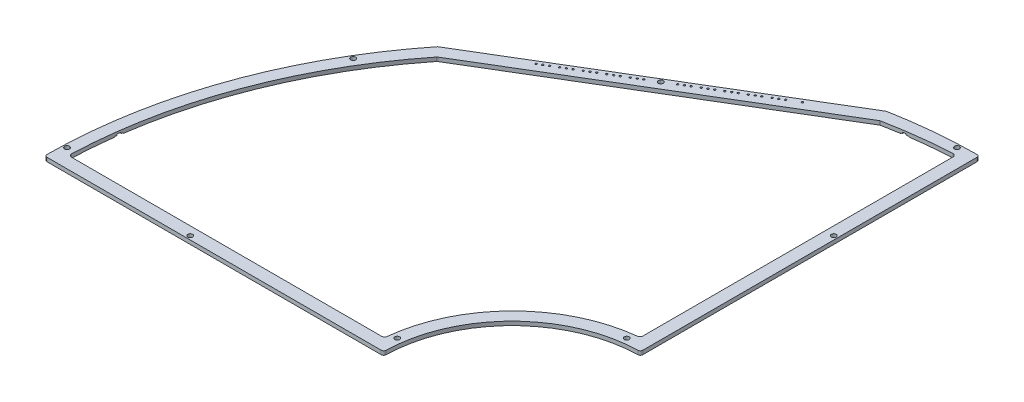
from build123d import *

# Parameters (mm, degrees)
EXTRUDE1_DEPTH  = 3.175
SKETCH2_R       = 2
EXTRUDE4_DEPTH  = 539.824257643
SKETCH4_R       = 0.75
EXTRUDE5_DEPTH  = 539.824257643
EXTRUDE6_START  = 3.175
EXTRUDE6_DEPTH  = 0.5
EXTRUDE9_DEPTH  = 1
EXTRUDE7_START  = 3.175
EXTRUDE7_DEPTH  = 0.5
EXTRUDE10_DEPTH = 1
FILLET2_R       = 2


with BuildPart() as part:
    # Sketch1 → Extrude1 (new body)
    with BuildSketch(Plane(origin=(0, 0, 0), x_dir=(1, 0, 0), z_dir=(0, 1, 0))):
        with BuildLine():
            Line((-69.791249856, 374.553309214), (-297.945935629, 237.464143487))
            ThreePointArc((-297.945935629, 237.464143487), (-359.554983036, 126.020689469), (-380.999671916, 0.5))
            Line((-380.999671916, 0.5), (-104.998809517, 0.5))
            ThreePointArc((-104.998809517, 0.5), (-74.246212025, 74.246212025), (-0.5, 104.998809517))
            Line((-0.5, 104.998809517), (-0.5, 380.999671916))
            ThreePointArc((-0.5, 380.999671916), (-35.293113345, 379.361827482), (-69.791249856, 374.553309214))
        make_face()
        with BuildLine():
            Line((-66.120558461, 365.092549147), (-290.534750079, 230.250899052))
            ThreePointArc((-290.534750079, 230.250899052), (-290.878735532, 229.999778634), (-291.172485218, 229.69139806))
            ThreePointArc((-291.172485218, 229.69139806), (-348.625003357, 127.74342555), (-371.465132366, 12.971872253))
            ThreePointArc((-371.465132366, 12.971872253), (-370.801146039, 11.229802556), (-369.085607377, 10.5))
            Line((-369.085607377, 10.5), (-116.627737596, 10.5))
            ThreePointArc((-116.627737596, 10.5), (-115.036426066, 11.10978756), (-114.260116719, 12.626842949))
            ThreePointArc((-114.260116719, 12.626842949), (-81.382579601, 81.510553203), (-12.618278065, 114.637110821))
            ThreePointArc((-12.618278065, 114.637110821), (-11.106911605, 115.415691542), (-10.5, 117.003795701))
            Line((-10.5, 117.003795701), (-10.5, 369.493251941))
            ThreePointArc((-10.5, 369.493251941), (-11.241858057, 371.220314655), (-13.005193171, 371.871274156))
            ThreePointArc((-13.005193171, 371.871274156), (-39.295002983, 369.561100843), (-65.354066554, 365.387827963))
            ThreePointArc((-65.354066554, 365.387827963), (-65.750140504, 365.273487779), (-66.120558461, 365.092549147))
        make_face(mode=Mode.SUBTRACT)
    extrude(amount=EXTRUDE1_DEPTH)

    # Sketch2 → Extrude4 (cut, through all)
    with BuildSketch(Plane(origin=(0, 0, 0), x_dir=(1, 0, 0), z_dir=(0, 1, 0))):
        with Locations(Location((-377.682075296, 15.5, 0), (0, 0, 270))):
            Circle(SKETCH2_R)
        with Locations(Location((-324.009239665, 194.684392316, 0), (0, 0, 270))):
            Circle(SKETCH2_R)
        with Locations(Location((-108.902479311, 15.5, 0), (0, 0, 270))):
            Circle(SKETCH2_R)
        with Locations(Location((-182.323478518, 303.437224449, 0), (0, 0, 270))):
            Circle(SKETCH2_R)
        with Locations(Location((-15.5, 108.902479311, 0), (0, 0, 270))):
            Circle(SKETCH2_R)
        with Locations(Location((-15.5, 377.682075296, 0), (0, 0, 270))):
            Circle(SKETCH2_R)
        with Locations(Location((-3.5, 265.406923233, 0), (0, 0, 270))):
            Circle(SKETCH2_R)
        with Locations(Location((-265.406923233, 3.5, 0), (0, 0, 270))):
            Circle(SKETCH2_R)
    extrude(amount=EXTRUDE4_DEPTH, mode=Mode.SUBTRACT)

    # Sketch4 → Extrude5 (cut, through all)
    with BuildSketch(Plane.XZ):
        with Locations(Location((-190.895151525, -298.286843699, 0), (0, 0, 270))):
            Circle(SKETCH4_R)
        with Locations(Location((-202.895493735, -291.076310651, 0), (0, 0, 270))):
            Circle(SKETCH4_R)
        with Locations(Location((-206.324162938, -289.016158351, 0), (0, 0, 270))):
            Circle(SKETCH4_R)
        with Locations(Location((-194.323820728, -296.2266914, 0), (0, 0, 270))):
            Circle(SKETCH4_R)
        with Locations(Location((-197.752489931, -294.1665391, 0), (0, 0, 270))):
            Circle(SKETCH4_R)
        with Locations(Location((-209.752832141, -286.956006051, 0), (0, 0, 270))):
            Circle(SKETCH4_R)
        with Locations(Location((-214.895835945, -283.865777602, 0), (0, 0, 270))):
            Circle(SKETCH4_R)
        with Locations(Location((-218.324505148, -281.805625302, 0), (0, 0, 270))):
            Circle(SKETCH4_R)
        with Locations(Location((-221.75317435, -279.745473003, 0), (0, 0, 270))):
            Circle(SKETCH4_R)
        with Locations(Location((-226.896178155, -276.655244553, 0), (0, 0, 270))):
            Circle(SKETCH4_R)
        with Locations(Location((-230.324847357, -274.595092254, 0), (0, 0, 270))):
            Circle(SKETCH4_R)
        with Locations(Location((-233.75351656, -272.534939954, 0), (0, 0, 270))):
            Circle(SKETCH4_R)
        with Locations(Location((-238.896520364, -269.444711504, 0), (0, 0, 270))):
            Circle(SKETCH4_R)
        with Locations(Location((-242.325189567, -267.384559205, 0), (0, 0, 270))):
            Circle(SKETCH4_R)
        with Locations(Location((-245.75385877, -265.324406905, 0), (0, 0, 270))):
            Circle(SKETCH4_R)
        with Locations(Location((-118.893098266, -341.550041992, 0), (0, 0, 90))):
            Circle(SKETCH4_R)
        with Locations(Location((-122.321767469, -339.489889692, 0), (0, 0, 90))):
            Circle(SKETCH4_R)
        with Locations(Location((-125.750436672, -337.429737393, 0), (0, 0, 90))):
            Circle(SKETCH4_R)
        with Locations(Location((-130.893440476, -334.339508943, 0), (0, 0, 90))):
            Circle(SKETCH4_R)
        with Locations(Location((-134.322109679, -332.279356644, 0), (0, 0, 90))):
            Circle(SKETCH4_R)
        with Locations(Location((-137.750778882, -330.219204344, 0), (0, 0, 90))):
            Circle(SKETCH4_R)
        with Locations(Location((-142.893782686, -327.128975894, 0), (0, 0, 90))):
            Circle(SKETCH4_R)
        with Locations(Location((-146.322451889, -325.068823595, 0), (0, 0, 90))):
            Circle(SKETCH4_R)
        with Locations(Location((-149.751121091, -323.008671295, 0), (0, 0, 90))):
            Circle(SKETCH4_R)
        with Locations(Location((-154.894124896, -319.918442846, 0), (0, 0, 90))):
            Circle(SKETCH4_R)
        with Locations(Location((-166.894467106, -312.707909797, 0), (0, 0, 90))):
            Circle(SKETCH4_R)
        with Locations(Location((-170.323136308, -310.647757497, 0), (0, 0, 90))):
            Circle(SKETCH4_R)
        with Locations(Location((-158.322794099, -317.858290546, 0), (0, 0, 90))):
            Circle(SKETCH4_R)
        with Locations(Location((-161.751463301, -315.798138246, 0), (0, 0, 90))):
            Circle(SKETCH4_R)
        with Locations(Location((-173.751805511, -308.587605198, 0), (0, 0, 90))):
            Circle(SKETCH4_R)
        with Locations(Location((-110.321425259, -346.700422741, 0), (0, 0, 270))):
            Circle(SKETCH4_R)
    extrude(amount=-EXTRUDE5_DEPTH, mode=Mode.SUBTRACT)

    # Sketch6 → Extrude6 (cut)
    with BuildSketch(Plane(origin=(0, 3.175, -3.175), x_dir=(1, 0, 0), z_dir=(0, -1, 0)).offset(EXTRUDE6_START)):
        with BuildLine():
            Line((-52.052182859, -369.2166893), (-50.746920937, -359.302240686))
            Line((-50.746920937, -359.302240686), (-44.798251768, -360.085397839))
            Line((-44.798251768, -360.085397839), (-46.103513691, -369.999846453))
            ThreePointArc((-46.103513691, -369.999846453), (-49.469426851, -372.582602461), (-52.052182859, -369.2166893))
        make_face()
    extrude(amount=-EXTRUDE6_DEPTH, mode=Mode.SUBTRACT)

    # Sketch8 → Extrude9 (cut)
    with BuildSketch(Plane.XZ.offset(-0.5)):
        with BuildLine():
            Line((-46.917157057, -368.552651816), (-50.056374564, -368.034449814))
            Line((-50.056374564, -368.034449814), (-50.654245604, -372.575731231))
            ThreePointArc((-50.654245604, -372.575731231), (-49.28538492, -374.359665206), (-47.501450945, -372.990804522))
            Line((-47.501450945, -372.990804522), (-46.917157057, -368.552651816))
        make_face()
    extrude(amount=-EXTRUDE9_DEPTH, mode=Mode.SUBTRACT)

    # Sketch6_7 → Extrude7 (cut)
    with BuildSketch(Plane(origin=(0, 3.175, -3.175), x_dir=(1, 0, 0), z_dir=(0, -1, 0)).offset(EXTRUDE7_START)):
        with BuildLine():
            ThreePointArc((-373.174846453, -42.928513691), (-375.757602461, -46.294426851), (-372.3916893, -48.877182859))
            Line((-372.3916893, -48.877182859), (-362.477240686, -47.571920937))
            Line((-362.477240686, -47.571920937), (-363.260397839, -41.623251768))
            Line((-363.260397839, -41.623251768), (-373.174846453, -42.928513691))
        make_face()
    extrude(amount=-EXTRUDE7_DEPTH, mode=Mode.SUBTRACT)

    # Sketch11 → Extrude10 (cut)
    with BuildSketch(Plane.XZ.offset(-0.5)):
        with BuildLine():
            Line((-368.602346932, -46.923699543), (-368.167501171, -50.073891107))
            Line((-368.167501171, -50.073891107), (-372.575731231, -50.654245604))
            ThreePointArc((-372.575731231, -50.654245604), (-374.359665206, -49.28538492), (-372.990804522, -47.501450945))
            Line((-372.990804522, -47.501450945), (-368.602346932, -46.923699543))
        make_face()
    extrude(amount=-EXTRUDE10_DEPTH, mode=Mode.SUBTRACT)

    # Fillet2
    fillet2_edges = [part.edges().sort_by_distance(p)[0] for p in [
        (-0.5, 1.5875, -380.999671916),
        (-0.5, 1.5875, -104.998809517),
        (-104.998809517, 1.5875, -0.5),
        (-380.999671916, 1.5875, -0.5),
    ]]
    fillet(fillet2_edges, radius=FILLET2_R)


solid = part.part
